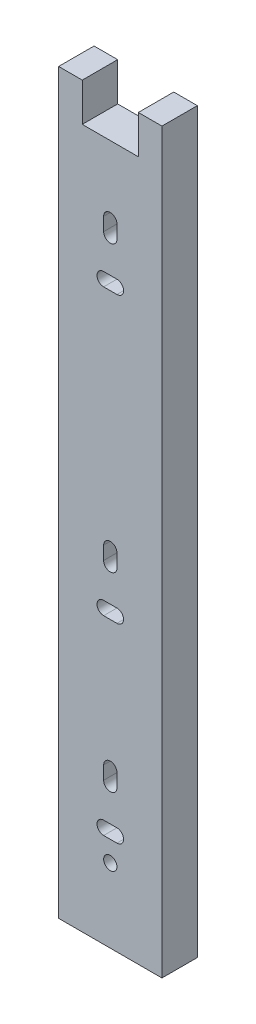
from build123d import *

# Parameters (mm, degrees)
SKETCH1_W           = 35
SKETCH1_H           = 250
BOSS_EXTRUDE1_DEPTH = 12
SKETCH2_W           = 19
SKETCH2_H           = 13
CUT_EXTRUDE1_DEPTH  = 25
SKETCH3_R           = 2.25
CUT_EXTRUDE2_DEPTH  = 21


with BuildPart() as part:
    # Sketch1 → Boss-Extrude1 (new body)
    with BuildSketch(Plane.XY):
        with Locations((-2.949438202, 103.436329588)):
            Rectangle(SKETCH1_W, SKETCH1_H)
    extrude(amount=BOSS_EXTRUDE1_DEPTH)

    # Sketch2 → Cut-Extrude1 (cut)
    with BuildSketch(Plane.XY):
        with Locations((-2.949438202, 221.936329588)):
            Rectangle(SKETCH2_W, SKETCH2_H)
    extrude(amount=CUT_EXTRUDE1_DEPTH, mode=Mode.SUBTRACT)

    # Sketch3 → Cut-Extrude2 (cut)
    with BuildSketch(Plane.XY.offset(12)):
        with Locations((-2.949438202, 3.436329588)):
            Circle(SKETCH3_R)
        with BuildLine():
            Line((-5.199438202, 14.886329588), (-0.699438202, 14.886329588))
            ThreePointArc((-0.699438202, 14.886329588), (1.550561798, 12.636329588), (-0.699438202, 10.386329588))
            Line((-0.699438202, 10.386329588), (-5.199438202, 10.386329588))
            ThreePointArc((-5.199438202, 10.386329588), (-7.449438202, 12.636329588), (-5.199438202, 14.886329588))
        make_face()
        with BuildLine():
            Line((-0.699438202, 31.086329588), (-0.699438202, 26.586329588))
            ThreePointArc((-0.699438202, 26.586329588), (-2.949438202, 24.336329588), (-5.199438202, 26.586329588))
            Line((-5.199438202, 26.586329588), (-5.199438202, 31.086329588))
            ThreePointArc((-5.199438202, 31.086329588), (-2.949438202, 33.336329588), (-0.699438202, 31.086329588))
        make_face()
        with BuildLine():
            Line((-5.199438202, 79.386329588), (-0.699438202, 79.386329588))
            ThreePointArc((-0.699438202, 79.386329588), (1.550561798, 77.136329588), (-0.699438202, 74.886329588))
            Line((-0.699438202, 74.886329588), (-5.199438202, 74.886329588))
            ThreePointArc((-5.199438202, 74.886329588), (-7.449438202, 77.136329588), (-5.199438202, 79.386329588))
        make_face()
        with BuildLine():
            Line((-0.699438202, 95.586329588), (-0.699438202, 91.086329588))
            ThreePointArc((-0.699438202, 91.086329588), (-2.949438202, 88.836329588), (-5.199438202, 91.086329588))
            Line((-5.199438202, 91.086329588), (-5.199438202, 95.586329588))
            ThreePointArc((-5.199438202, 95.586329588), (-2.949438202, 97.836329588), (-0.699438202, 95.586329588))
        make_face()
        with BuildLine():
            Line((-5.199438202, 175.886329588), (-0.699438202, 175.886329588))
            ThreePointArc((-0.699438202, 175.886329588), (1.550561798, 173.636329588), (-0.699438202, 171.386329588))
            Line((-0.699438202, 171.386329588), (-5.199438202, 171.386329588))
            ThreePointArc((-5.199438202, 171.386329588), (-7.449438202, 173.636329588), (-5.199438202, 175.886329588))
        make_face()
        with BuildLine():
            Line((-0.699438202, 192.086329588), (-0.699438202, 187.586329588))
            ThreePointArc((-0.699438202, 187.586329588), (-2.949438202, 185.336329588), (-5.199438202, 187.586329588))
            Line((-5.199438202, 187.586329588), (-5.199438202, 192.086329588))
            ThreePointArc((-5.199438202, 192.086329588), (-2.949438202, 194.336329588), (-0.699438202, 192.086329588))
        make_face()
    extrude(amount=-CUT_EXTRUDE2_DEPTH, mode=Mode.SUBTRACT)


solid = part.part
